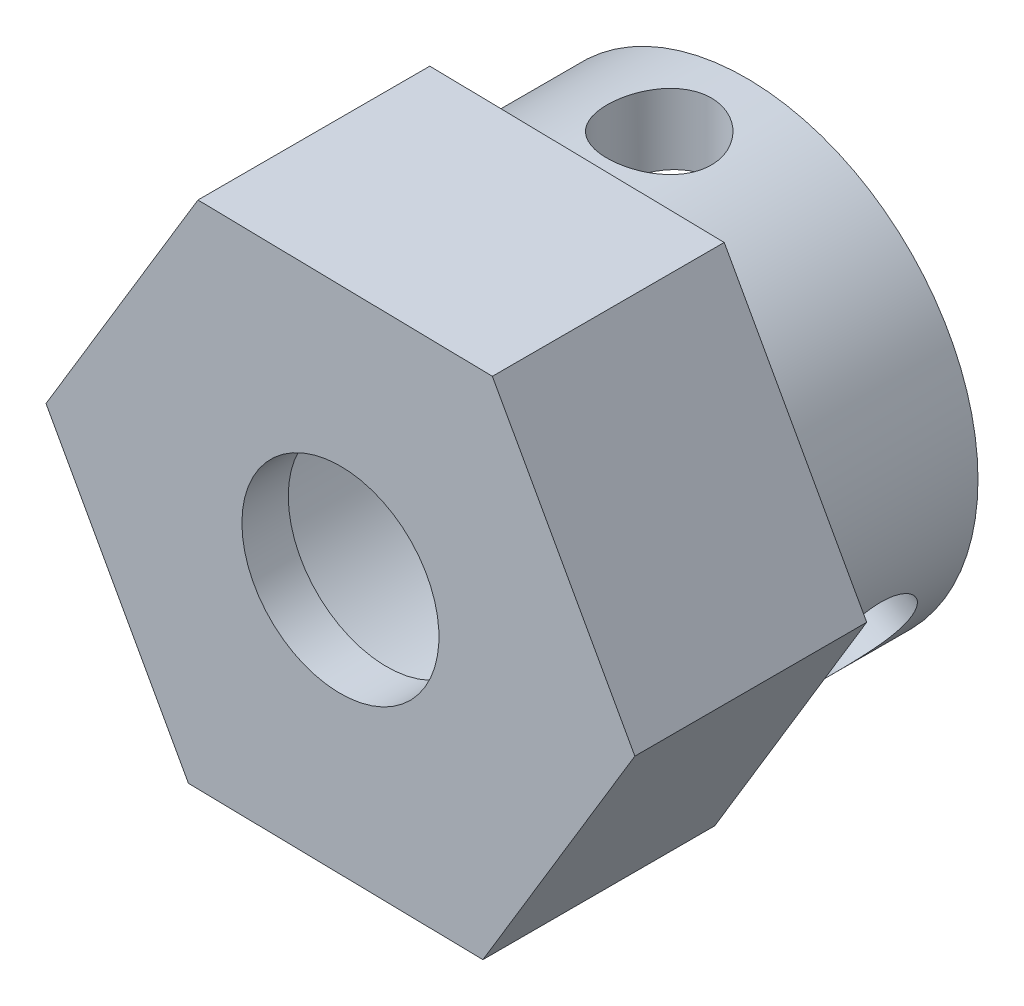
ISO-10303-21;
HEADER;
FILE_DESCRIPTION(('STEP AP214'),'2;1');
FILE_NAME('part.step','',(''),(''),'','','');
FILE_SCHEMA(('AUTOMOTIVE_DESIGN { 1 0 10303 214 1 1 1 1 }'));
ENDSEC;
DATA;
#1=APPLICATION_CONTEXT('core data for automotive mechanical design processes');
#2=APPLICATION_PROTOCOL_DEFINITION('international standard','automotive_design',2000,#1);
#3=PRODUCT_CONTEXT('',#1,'mechanical');
#4=PRODUCT('Part','Part','',(#3));
#5=PRODUCT_RELATED_PRODUCT_CATEGORY('part','',(#4));
#6=PRODUCT_DEFINITION_FORMATION('','',#4);
#7=PRODUCT_DEFINITION_CONTEXT('part definition',#1,'design');
#8=PRODUCT_DEFINITION('design','',#6,#7);
#9=PRODUCT_DEFINITION_SHAPE('','',#8);
#10=(LENGTH_UNIT() NAMED_UNIT(*) SI_UNIT(.MILLI.,.METRE.));
#11=(NAMED_UNIT(*) PLANE_ANGLE_UNIT() SI_UNIT($,.RADIAN.));
#12=(NAMED_UNIT(*) SI_UNIT($,.STERADIAN.) SOLID_ANGLE_UNIT());
#13=UNCERTAINTY_MEASURE_WITH_UNIT(LENGTH_MEASURE(1.E-05),#10,'distance_accuracy_value','');
#14=(GEOMETRIC_REPRESENTATION_CONTEXT(3) GLOBAL_UNCERTAINTY_ASSIGNED_CONTEXT((#13)) GLOBAL_UNIT_ASSIGNED_CONTEXT((#10,
#11,#12)) REPRESENTATION_CONTEXT('',''));
#15=CARTESIAN_POINT('',(0.,0.,0.));
#16=DIRECTION('',(0.,0.,1.));
#17=DIRECTION('',(1.,0.,0.));
#18=AXIS2_PLACEMENT_3D('',#15,#16,#17);
#19=CARTESIAN_POINT('',(0.,0.,-8.89));
#20=DIRECTION('',(0.,0.,1.));
#21=DIRECTION('',(1.,0.,0.));
#22=AXIS2_PLACEMENT_3D('',#19,#20,#21);
#23=CYLINDRICAL_SURFACE('',#22,5.08);
#24=CARTESIAN_POINT('',(-4.85810276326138,-1.48500422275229,-6.985));
#25=CARTESIAN_POINT('',(-4.85810281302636,-1.48500669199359,-6.92167529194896));
#26=CARTESIAN_POINT('',(-4.85652644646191,-1.49019141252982,-6.85832558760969));
#27=CARTESIAN_POINT('',(-4.85018004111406,-1.51071664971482,-6.73343108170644));
#28=CARTESIAN_POINT('',(-4.8454077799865,-1.52606423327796,-6.67188756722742));
#29=CARTESIAN_POINT('',(-4.83256581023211,-1.56625321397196,-6.55243010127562));
#30=CARTESIAN_POINT('',(-4.82449983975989,-1.59108384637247,-6.49451212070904));
#31=CARTESIAN_POINT('',(-4.80491702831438,-1.64927582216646,-6.38378022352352));
#32=CARTESIAN_POINT('',(-4.79340021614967,-1.68263709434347,-6.33096626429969));
#33=CARTESIAN_POINT('',(-4.76653900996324,-1.75729927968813,-6.2309975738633));
#34=CARTESIAN_POINT('',(-4.75113612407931,-1.79871908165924,-6.1839473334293));
#35=CARTESIAN_POINT('',(-4.71647810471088,-1.88772647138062,-6.09775782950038));
#36=CARTESIAN_POINT('',(-4.69722266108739,-1.93531455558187,-6.05861920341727));
#37=CARTESIAN_POINT('',(-4.65461791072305,-2.03566494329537,-5.98894788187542));
#38=CARTESIAN_POINT('',(-4.63122531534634,-2.08847906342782,-5.9585161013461));
#39=CARTESIAN_POINT('',(-4.5806938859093,-2.19709495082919,-5.90777581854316));
#40=CARTESIAN_POINT('',(-4.55355549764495,-2.25289636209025,-5.88746611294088));
#41=CARTESIAN_POINT('',(-4.49647154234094,-2.36474499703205,-5.85787629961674));
#42=CARTESIAN_POINT('',(-4.4665798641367,-2.42077287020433,-5.84841922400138));
#43=CARTESIAN_POINT('',(-4.40434166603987,-2.53224148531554,-5.84024940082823));
#44=CARTESIAN_POINT('',(-4.37199544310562,-2.58768229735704,-5.84153535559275));
#45=CARTESIAN_POINT('',(-4.30642272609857,-2.69537167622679,-5.85468414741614));
#46=CARTESIAN_POINT('',(-4.27322255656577,-2.74765974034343,-5.86635618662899));
#47=CARTESIAN_POINT('',(-4.20650582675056,-2.84875040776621,-5.89964127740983));
#48=CARTESIAN_POINT('',(-4.17298925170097,-2.89755284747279,-5.92125479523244));
#49=CARTESIAN_POINT('',(-4.10660651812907,-2.99090145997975,-5.97397529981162));
#50=CARTESIAN_POINT('',(-4.07374731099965,-3.0354121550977,-6.00515375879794));
#51=CARTESIAN_POINT('',(-4.01023305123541,-3.11884340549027,-6.07606564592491));
#52=CARTESIAN_POINT('',(-3.97957831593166,-3.15776315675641,-6.11580030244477));
#53=CARTESIAN_POINT('',(-3.92111564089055,-3.23008751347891,-6.20373247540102));
#54=CARTESIAN_POINT('',(-3.89338517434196,-3.26335193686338,-6.25209695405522));
#55=CARTESIAN_POINT('',(-3.84286046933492,-3.32270176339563,-6.35537238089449));
#56=CARTESIAN_POINT('',(-3.82006638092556,-3.34878694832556,-6.41028352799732));
#57=CARTESIAN_POINT('',(-3.780507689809,-3.39338435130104,-6.52536286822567));
#58=CARTESIAN_POINT('',(-3.76376314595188,-3.4118714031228,-6.58554774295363));
#59=CARTESIAN_POINT('',(-3.73734361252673,-3.44079212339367,-6.70930732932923));
#60=CARTESIAN_POINT('',(-3.72766742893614,-3.45122715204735,-6.77288146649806));
#61=CARTESIAN_POINT('',(-3.71608033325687,-3.46370012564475,-6.90014751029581));
#62=CARTESIAN_POINT('',(-3.71400663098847,-3.46591411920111,-6.96380737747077));
#63=CARTESIAN_POINT('',(-3.71729279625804,-3.46238934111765,-7.09071001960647));
#64=CARTESIAN_POINT('',(-3.72265212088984,-3.45665115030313,-7.15395282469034));
#65=CARTESIAN_POINT('',(-3.7403777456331,-3.4374612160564,-7.27740166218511));
#66=CARTESIAN_POINT('',(-3.752654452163,-3.42410807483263,-7.33763600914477));
#67=CARTESIAN_POINT('',(-3.78348450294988,-3.3900103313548,-7.45428350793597));
#68=CARTESIAN_POINT('',(-3.80203847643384,-3.36926498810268,-7.51069627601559));
#69=CARTESIAN_POINT('',(-3.84483572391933,-3.32034749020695,-7.6191072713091));
#70=CARTESIAN_POINT('',(-3.86916637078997,-3.29206036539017,-7.67101908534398));
#71=CARTESIAN_POINT('',(-3.92218656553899,-3.22870794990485,-7.76803942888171));
#72=CARTESIAN_POINT('',(-3.95087668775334,-3.19364176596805,-7.81314706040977));
#73=CARTESIAN_POINT('',(-4.01195015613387,-3.11658718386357,-7.89619381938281));
#74=CARTESIAN_POINT('',(-4.04439545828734,-3.07447530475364,-7.93397305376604));
#75=CARTESIAN_POINT('',(-4.1111067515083,-2.98468170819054,-8.00014382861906));
#76=CARTESIAN_POINT('',(-4.14537265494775,-2.9370002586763,-8.0285358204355));
#77=CARTESIAN_POINT('',(-4.21411013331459,-2.83748220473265,-8.07490724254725));
#78=CARTESIAN_POINT('',(-4.24857882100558,-2.78567537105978,-8.09295472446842));
#79=CARTESIAN_POINT('',(-4.31665742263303,-2.67896808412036,-8.11833603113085));
#80=CARTESIAN_POINT('',(-4.35026746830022,-2.6240681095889,-8.12567150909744));
#81=CARTESIAN_POINT('',(-4.4147866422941,-2.51396929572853,-8.12934264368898));
#82=CARTESIAN_POINT('',(-4.4457388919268,-2.45880353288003,-8.1259164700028));
#83=CARTESIAN_POINT('',(-4.50491361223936,-2.34863026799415,-8.10869672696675));
#84=CARTESIAN_POINT('',(-4.53313613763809,-2.29362276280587,-8.09490336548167));
#85=CARTESIAN_POINT('',(-4.58617880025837,-2.18562885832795,-8.0574576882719));
#86=CARTESIAN_POINT('',(-4.61101079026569,-2.13263591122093,-8.03384095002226));
#87=CARTESIAN_POINT('',(-4.65707873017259,-2.03006953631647,-7.97745293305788));
#88=CARTESIAN_POINT('',(-4.67831430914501,-1.98049646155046,-7.94468071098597));
#89=CARTESIAN_POINT('',(-4.71747218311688,-1.88535368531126,-7.87014496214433));
#90=CARTESIAN_POINT('',(-4.7353198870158,-1.83988363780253,-7.82821502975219));
#91=CARTESIAN_POINT('',(-4.76722061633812,-1.75557516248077,-7.73688740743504));
#92=CARTESIAN_POINT('',(-4.78127271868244,-1.71673834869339,-7.68748790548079));
#93=CARTESIAN_POINT('',(-4.80589712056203,-1.64655986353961,-7.58177154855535));
#94=CARTESIAN_POINT('',(-4.8164166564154,-1.61533360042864,-7.52536569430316));
#95=CARTESIAN_POINT('',(-4.83386659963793,-1.56234371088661,-7.40779030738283));
#96=CARTESIAN_POINT('',(-4.84079996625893,-1.54057228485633,-7.34662475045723));
#97=CARTESIAN_POINT('',(-4.85006780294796,-1.5110992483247,-7.23535537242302));
#98=CARTESIAN_POINT('',(-4.85308454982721,-1.50133836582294,-7.18584290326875));
#99=CARTESIAN_POINT('',(-4.85710195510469,-1.48829004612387,-7.08589221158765));
#100=CARTESIAN_POINT('',(-4.85810272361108,-1.48500225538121,-7.03545403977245));
#101=CARTESIAN_POINT('',(-4.85810276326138,-1.48500422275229,-6.985));
#102=B_SPLINE_CURVE_WITH_KNOTS('',3,(#24,#25,#26,#27,#28,#29,#30,#31,#32,#33,#34,#35,#36,#37,
#38,#39,#40,#41,#42,#43,#44,#45,#46,#47,#48,#49,#50,#51,#52,#53,#54,#55,#56,#57,#58,#59,#60,#61,
#62,#63,#64,#65,#66,#67,#68,#69,#70,#71,#72,#73,#74,#75,#76,#77,#78,#79,#80,#81,#82,#83,#84,#85,
#86,#87,#88,#89,#90,#91,#92,#93,#94,#95,#96,#97,#98,#99,#100,#101),.UNSPECIFIED.,.T.,.F.,(4,2,2,
2,2,2,2,2,2,2,2,2,2,2,2,2,2,2,2,2,2,2,2,2,2,2,2,2,2,2,2,2,2,2,2,2,2,2,4),(0.,0.189789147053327,
0.379710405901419,0.56941671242,0.759121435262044,0.951872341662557,1.14463877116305,
1.3395564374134,1.53445092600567,1.7261200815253,1.91776608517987,2.10596250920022,
2.29416776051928,2.48381508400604,2.67348965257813,2.8673373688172,3.0611909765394,
3.25568158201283,3.45013932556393,3.64040803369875,3.83066284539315,4.01850833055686,
4.2063726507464,4.39728316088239,4.58821884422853,4.78294086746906,4.97765352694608,
5.17107011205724,5.36445684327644,5.55359406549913,5.74272749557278,5.93118182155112,
6.11965557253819,6.31189115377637,6.50417344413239,6.69921175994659,6.89408887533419,
7.04531187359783,7.19652661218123),.UNSPECIFIED.);
#103=CARTESIAN_POINT('',(-4.85810276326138,-1.48500422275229,-6.985));
#104=VERTEX_POINT('',#103);
#105=EDGE_CURVE('E221',#104,#104,#102,.T.);
#106=ORIENTED_EDGE('',*,*,#105,.T.);
#107=EDGE_LOOP('',(#106));
#108=FACE_BOUND('',#107,.T.);
#109=CARTESIAN_POINT('',(0.,0.,-5.08));
#110=DIRECTION('',(0.,0.,1.));
#111=DIRECTION('',(1.,0.,0.));
#112=AXIS2_PLACEMENT_3D('',#109,#110,#111);
#113=CIRCLE('',#112,5.08);
#114=CARTESIAN_POINT('',(5.08,0.,-5.08));
#115=VERTEX_POINT('',#114);
#116=EDGE_CURVE('E47',#115,#115,#113,.F.);
#117=ORIENTED_EDGE('',*,*,#116,.T.);
#118=EDGE_LOOP('',(#117));
#119=FACE_BOUND('',#118,.T.);
#120=CARTESIAN_POINT('',(0.,0.,-8.89));
#121=DIRECTION('',(0.,0.,1.));
#122=DIRECTION('',(1.,0.,0.));
#123=AXIS2_PLACEMENT_3D('',#120,#121,#122);
#124=CIRCLE('',#123,5.08);
#125=CARTESIAN_POINT('',(5.08,0.,-8.89));
#126=VERTEX_POINT('',#125);
#127=EDGE_CURVE('E11',#126,#126,#124,.T.);
#128=ORIENTED_EDGE('',*,*,#127,.T.);
#129=EDGE_LOOP('',(#128));
#130=FACE_BOUND('',#129,.T.);
#131=CARTESIAN_POINT('',(0.,5.08,-8.128));
#132=CARTESIAN_POINT('',(0.0633475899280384,5.07999884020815,-8.12799790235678));
#133=CARTESIAN_POINT('',(0.126720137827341,5.0788030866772,-8.12271593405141));
#134=CARTESIAN_POINT('',(0.251662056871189,5.07414854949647,-8.10175139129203));
#135=CARTESIAN_POINT('',(0.313230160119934,5.07068821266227,-8.0860616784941));
#136=CARTESIAN_POINT('',(0.4327397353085,5.06188939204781,-8.04480039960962));
#137=CARTESIAN_POINT('',(0.490685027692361,5.05655292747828,-8.01923945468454));
#138=CARTESIAN_POINT('',(0.601463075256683,5.04457634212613,-7.9589957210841));
#139=CARTESIAN_POINT('',(0.65429590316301,5.0379362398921,-7.92431306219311));
#140=CARTESIAN_POINT('',(0.754244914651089,5.02395291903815,-7.84618955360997));
#141=CARTESIAN_POINT('',(0.801262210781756,5.01660056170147,-7.80262381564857));
#142=CARTESIAN_POINT('',(0.887387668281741,5.00208506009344,-7.70823879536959));
#143=CARTESIAN_POINT('',(0.926495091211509,4.99492193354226,-7.65741883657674));
#144=CARTESIAN_POINT('',(0.996132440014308,4.9815054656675,-7.54922982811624));
#145=CARTESIAN_POINT('',(1.02655607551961,4.97526381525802,-7.49179078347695));
#146=CARTESIAN_POINT('',(1.07728011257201,4.96452860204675,-7.37245151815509));
#147=CARTESIAN_POINT('',(1.09758180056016,4.96003481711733,-7.31055186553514));
#148=CARTESIAN_POINT('',(1.1271568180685,4.95339738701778,-7.18512409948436));
#149=CARTESIAN_POINT('',(1.13660576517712,4.9512163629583,-7.12163941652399));
#150=CARTESIAN_POINT('',(1.14475333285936,4.94933921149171,-6.99395133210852));
#151=CARTESIAN_POINT('',(1.14345335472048,4.94964276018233,-6.92974802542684));
#152=CARTESIAN_POINT('',(1.13028106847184,4.95266666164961,-6.80375829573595));
#153=CARTESIAN_POINT('',(1.11861375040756,4.95534015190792,-6.74194914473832));
#154=CARTESIAN_POINT('',(1.08536316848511,4.96272849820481,-6.62118864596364));
#155=CARTESIAN_POINT('',(1.06377931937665,4.96744347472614,-6.56223746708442));
#156=CARTESIAN_POINT('',(1.01112275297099,4.97842910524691,-6.44829514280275));
#157=CARTESIAN_POINT('',(0.979972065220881,4.98471245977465,-6.39334130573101));
#158=CARTESIAN_POINT('',(0.909120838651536,4.99811920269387,-6.28936540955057));
#159=CARTESIAN_POINT('',(0.869419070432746,5.00524271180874,-6.2403442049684));
#160=CARTESIAN_POINT('',(0.781511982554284,5.01972748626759,-6.14844590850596));
#161=CARTESIAN_POINT('',(0.733132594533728,5.02709045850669,-6.10573542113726));
#162=CARTESIAN_POINT('',(0.629813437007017,5.04107611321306,-6.02900598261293));
#163=CARTESIAN_POINT('',(0.574873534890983,5.04769878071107,-5.99498720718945));
#164=CARTESIAN_POINT('',(0.459783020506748,5.05948113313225,-5.93656195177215));
#165=CARTESIAN_POINT('',(0.399620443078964,5.06463733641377,-5.91217829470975));
#166=CARTESIAN_POINT('',(0.275909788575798,5.0728800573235,-5.87391353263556));
#167=CARTESIAN_POINT('',(0.212362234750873,5.07596689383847,-5.860030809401));
#168=CARTESIAN_POINT('',(0.08511369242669,5.07967734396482,-5.84340661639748));
#169=CARTESIAN_POINT('',(0.0214438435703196,5.08035123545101,-5.84043770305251));
#170=CARTESIAN_POINT('',(-0.105482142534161,5.0793011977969,-5.84510753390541));
#171=CARTESIAN_POINT('',(-0.168738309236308,5.07757744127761,-5.85274551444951));
#172=CARTESIAN_POINT('',(-0.292280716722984,5.071957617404,-5.87822389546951));
#173=CARTESIAN_POINT('',(-0.352593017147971,5.06808715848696,-5.89594408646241));
#174=CARTESIAN_POINT('',(-0.469388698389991,5.05860756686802,-5.94094971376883));
#175=CARTESIAN_POINT('',(-0.525871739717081,5.05299828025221,-5.9682359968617));
#176=CARTESIAN_POINT('',(-0.634339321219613,5.0405398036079,-6.03206677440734));
#177=CARTESIAN_POINT('',(-0.686243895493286,5.03367331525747,-6.0687437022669));
#178=CARTESIAN_POINT('',(-0.783243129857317,5.01949573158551,-6.15014125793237));
#179=CARTESIAN_POINT('',(-0.828336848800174,5.01218457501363,-6.19486299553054));
#180=CARTESIAN_POINT('',(-0.911340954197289,4.99776657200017,-6.29212700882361));
#181=CARTESIAN_POINT('',(-0.949093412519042,4.99066652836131,-6.34480525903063));
#182=CARTESIAN_POINT('',(-1.01521721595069,4.97763742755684,-6.45588735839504));
#183=CARTESIAN_POINT('',(-1.04358897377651,4.97170831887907,-6.51429095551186));
#184=CARTESIAN_POINT('',(-1.08994921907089,4.96175103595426,-6.63484917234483));
#185=CARTESIAN_POINT('',(-1.1079972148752,4.95771199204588,-6.69697996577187));
#186=CARTESIAN_POINT('',(-1.13336929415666,4.95197398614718,-6.82349564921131));
#187=CARTESIAN_POINT('',(-1.14069520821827,4.95027462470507,-6.88788015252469));
#188=CARTESIAN_POINT('',(-1.14433376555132,4.94943459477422,-7.01548066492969));
#189=CARTESIAN_POINT('',(-1.14089715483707,4.95023566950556,-7.07868926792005));
#190=CARTESIAN_POINT('',(-1.12367131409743,4.95417393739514,-7.20360170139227));
#191=CARTESIAN_POINT('',(-1.10988222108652,4.95731109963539,-7.26530555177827));
#192=CARTESIAN_POINT('',(-1.07246713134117,4.96553886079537,-7.38524375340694));
#193=CARTESIAN_POINT('',(-1.0488796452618,4.97062180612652,-7.44349067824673));
#194=CARTESIAN_POINT('',(-0.992569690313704,4.98217099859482,-7.55523698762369));
#195=CARTESIAN_POINT('',(-0.959846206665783,4.98863739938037,-7.60873584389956));
#196=CARTESIAN_POINT('',(-0.885370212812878,5.00239742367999,-7.71069890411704));
#197=CARTESIAN_POINT('',(-0.843439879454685,5.00970575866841,-7.75903126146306));
#198=CARTESIAN_POINT('',(-0.752098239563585,5.02422956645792,-7.84805581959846));
#199=CARTESIAN_POINT('',(-0.702685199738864,5.0314450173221,-7.88874624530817));
#200=CARTESIAN_POINT('',(-0.596952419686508,5.0450892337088,-7.96187568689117));
#201=CARTESIAN_POINT('',(-0.540546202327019,5.05150566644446,-7.994192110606));
#202=CARTESIAN_POINT('',(-0.422968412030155,5.06270412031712,-8.04883360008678));
#203=CARTESIAN_POINT('',(-0.361800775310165,5.06748747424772,-8.0711668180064));
#204=CARTESIAN_POINT('',(-0.250501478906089,5.0740547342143,-8.10135227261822));
#205=CARTESIAN_POINT('',(-0.200959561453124,5.07627012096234,-8.11132564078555));
#206=CARTESIAN_POINT('',(-0.100950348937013,5.07924318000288,-8.12465017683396));
#207=CARTESIAN_POINT('',(-0.0504830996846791,5.08000092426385,-8.12800167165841));
#208=CARTESIAN_POINT('',(0.,5.08,-8.128));
#209=B_SPLINE_CURVE_WITH_KNOTS('',3,(#131,#132,#133,#134,#135,#136,#137,#138,#139,#140,#141,
#142,#143,#144,#145,#146,#147,#148,#149,#150,#151,#152,#153,#154,#155,#156,#157,#158,#159,#160,
#161,#162,#163,#164,#165,#166,#167,#168,#169,#170,#171,#172,#173,#174,#175,#176,#177,#178,#179,
#180,#181,#182,#183,#184,#185,#186,#187,#188,#189,#190,#191,#192,#193,#194,#195,#196,#197,#198,
#199,#200,#201,#202,#203,#204,#205,#206,#207,#208),.UNSPECIFIED.,.T.,.F.,(4,2,2,2,2,2,2,2,2,2,2,
2,2,2,2,2,2,2,2,2,2,2,2,2,2,2,2,2,2,2,2,2,2,2,2,2,2,2,4),(0.,0.189857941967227,
0.379846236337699,0.569630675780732,0.759412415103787,0.952073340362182,1.14475224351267,
1.33969726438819,1.534617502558,1.72633704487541,1.91803159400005,2.10601813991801,
2.29401578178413,2.48358821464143,2.67318792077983,2.86713391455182,3.06108382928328,
3.25549044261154,3.4498670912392,3.64016920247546,3.83045761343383,4.018523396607,
4.20660583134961,4.39750280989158,4.58842614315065,4.7830875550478,4.97774040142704,
5.17125961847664,5.36474579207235,5.55375792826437,5.74276756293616,5.93104125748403,
6.11933587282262,6.31164982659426,6.50400839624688,6.69904148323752,6.89391501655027,
7.04522449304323,7.19652649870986),.UNSPECIFIED.);
#210=CARTESIAN_POINT('',(0.,5.08,-8.128));
#211=VERTEX_POINT('',#210);
#212=EDGE_CURVE('E162',#211,#211,#209,.T.);
#213=ORIENTED_EDGE('',*,*,#212,.T.);
#214=EDGE_LOOP('',(#213));
#215=FACE_BOUND('',#214,.T.);
#216=CARTESIAN_POINT('',(3.71510276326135,-3.46473829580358,-6.985));
#217=CARTESIAN_POINT('',(3.71510492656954,-3.46473710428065,-6.92167529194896));
#218=CARTESIAN_POINT('',(3.71880684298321,-3.46077957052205,-6.85832558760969));
#219=CARTESIAN_POINT('',(3.7334090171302,-3.4450208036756,-6.73343108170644));
#220=CARTESIAN_POINT('',(3.7443142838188,-3.43321411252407,-6.67188756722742));
#221=CARTESIAN_POINT('',(3.77269797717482,-3.40199815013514,-6.55243010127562));
#222=CARTESIAN_POINT('',(3.79016895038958,-3.38259749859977,-6.49451212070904));
#223=CARTESIAN_POINT('',(3.83077327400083,-3.33654229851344,-6.38378022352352));
#224=CARTESIAN_POINT('',(3.85390657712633,-3.30988781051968,-6.33096626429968));
#225=CARTESIAN_POINT('',(3.90513532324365,-3.24929423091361,-6.2309975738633));
#226=CARTESIAN_POINT('',(3.93330448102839,-3.21524503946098,-6.1839473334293));
#227=CARTESIAN_POINT('',(3.99305813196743,-3.14072661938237,-6.09775782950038));
#228=CARTESIAN_POINT('',(4.0246428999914,-3.10025687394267,-6.05861920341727));
#229=CARTESIAN_POINT('',(4.09024650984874,-3.01318488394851,-5.98894788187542));
#230=CARTESIAN_POINT('',(4.1242885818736,-2.9665192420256,-5.9585161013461));
#231=CARTESIAN_POINT('',(4.19308698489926,-2.8684497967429,-5.90777581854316));
#232=CARTESIAN_POINT('',(4.22784323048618,-2.81704655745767,-5.88746611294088));
#233=CARTESIAN_POINT('',(4.29616501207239,-2.711686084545,-5.85787629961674));
#234=CARTESIAN_POINT('',(4.32974073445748,-2.65778519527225,-5.84841922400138));
#235=CARTESIAN_POINT('',(4.39515628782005,-2.54815102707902,-5.84024940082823));
#236=CARTESIAN_POINT('',(4.4269963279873,-2.49241797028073,-5.84153535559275));
#237=CARTESIAN_POINT('',(4.48747170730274,-2.38178564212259,-5.85468414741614));
#238=CARTESIAN_POINT('',(4.51615441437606,-2.32688941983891,-5.86635618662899));
#239=CARTESIAN_POINT('',(4.5703431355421,-2.21856570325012,-5.89964127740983));
#240=CARTESIAN_POINT('',(4.59584900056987,-2.16513827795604,-5.92125479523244));
#241=CARTESIAN_POINT('',(4.64349990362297,-2.06097483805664,-5.97397529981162));
#242=CARTESIAN_POINT('',(4.66561769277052,-2.01026258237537,-6.00515375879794));
#243=CARTESIAN_POINT('',(4.70611414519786,-1.91354199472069,-6.07606564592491));
#244=CARTESIAN_POINT('',(4.72449227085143,-1.86753433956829,-6.11580030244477));
#245=CARTESIAN_POINT('',(4.75789566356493,-1.78074199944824,-6.20373247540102));
#246=CARTESIAN_POINT('',(4.77283826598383,-1.74009449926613,-6.25209695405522));
#247=CARTESIAN_POINT('',(4.79897437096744,-1.6666639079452,-6.35537238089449));
#248=CARTESIAN_POINT('',(4.81016775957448,-1.63388105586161,-6.41028352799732));
#249=CARTESIAN_POINT('',(4.82901089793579,-1.57732352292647,-6.52536286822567));
#250=CARTESIAN_POINT('',(4.83664888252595,-1.55357879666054,-6.58554774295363));
#251=CARTESIAN_POINT('',(4.84848519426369,-1.51623844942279,-6.70930732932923));
#252=CARTESIAN_POINT('',(4.8526841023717,-1.50264111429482,-6.77288146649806));
#253=CARTESIAN_POINT('',(4.85769246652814,-1.4863699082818,-6.90014751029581));
#254=CARTESIAN_POINT('',(4.85857299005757,-1.4834670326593,-6.96380737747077));
#255=CARTESIAN_POINT('',(4.85716352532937,-1.48807532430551,-7.09071001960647));
#256=CARTESIAN_POINT('',(4.85487376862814,-1.49558573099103,-7.15395282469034));
#257=CARTESIAN_POINT('',(4.84711761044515,-1.52053153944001,-7.27740166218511));
#258=CARTESIAN_POINT('',(4.84169180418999,-1.5378400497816,-7.33763600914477));
#259=CARTESIAN_POINT('',(4.8275773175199,-1.58158852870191,-7.45428350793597));
#260=CARTESIAN_POINT('',(4.81888830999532,-1.60802941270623,-7.51069627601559));
#261=CARTESIAN_POINT('',(4.7979231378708,-1.66955166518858,-7.6191072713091));
#262=CARTESIAN_POINT('',(4.78559109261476,-1.70476618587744,-7.67101908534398));
#263=CARTESIAN_POINT('',(4.75723638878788,-1.78235922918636,-7.76803942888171));
#264=CARTESIAN_POINT('',(4.741213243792,-1.82473869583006,-7.81314706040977));
#265=CARTESIAN_POINT('',(4.7050187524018,-1.91615716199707,-7.89619381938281));
#266=CARTESIAN_POINT('',(4.68477144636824,-1.9653115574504,-7.93397305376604));
#267=CARTESIAN_POINT('',(4.6403635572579,-2.06798203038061,-8.00014382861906));
#268=CARTESIAN_POINT('',(4.61620316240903,-2.12149789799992,-8.0285358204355));
#269=CARTESIAN_POINT('',(4.56438673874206,-2.23078532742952,-8.07490724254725));
#270=CARTESIAN_POINT('',(4.53675504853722,-2.28653950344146,-8.09295472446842));
#271=CARTESIAN_POINT('',(4.47838312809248,-2.39885094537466,-8.11833603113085));
#272=CARTESIAN_POINT('',(4.44764337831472,-2.45540808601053,-8.12567150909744));
#273=CARTESIAN_POINT('',(4.38455459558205,-2.56633273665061,-8.12934264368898));
#274=CARTESIAN_POINT('',(4.35225576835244,-2.62072105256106,-8.1259164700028));
#275=CARTESIAN_POINT('',(4.28643028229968,-2.72705449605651,-8.10869672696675));
#276=CARTESIAN_POINT('',(4.25290364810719,-2.7789996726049,-8.09490336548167));
#277=CARTESIAN_POINT('',(4.18589951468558,-2.8789329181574,-8.0574576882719));
#278=CARTESIAN_POINT('',(4.15242227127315,-2.92693452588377,-8.03384095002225));
#279=CARTESIAN_POINT('',(4.08663115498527,-3.01811371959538,-7.97745293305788));
#280=CARTESIAN_POINT('',(4.0543174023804,-3.06129080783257,-7.94468071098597));
#281=CARTESIAN_POINT('',(3.99150027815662,-3.14277390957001,-7.87014496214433));
#282=CARTESIAN_POINT('',(3.96104591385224,-3.18096549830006,-7.82821502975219));
#283=CARTESIAN_POINT('',(3.90398299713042,-3.25074657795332,-7.73688740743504));
#284=CARTESIAN_POINT('',(3.87737538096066,-3.28233446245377,-7.68748790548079));
#285=CARTESIAN_POINT('',(3.82891123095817,-3.33874906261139,-7.58177154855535));
#286=CARTESIAN_POINT('',(3.8071282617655,-3.3634723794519,-7.52536569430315));
#287=CARTESIAN_POINT('',(3.76996264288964,-3.40507941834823,-7.40779030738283));
#288=CARTESIAN_POINT('',(3.7545747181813,-3.4219696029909,-7.34662475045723));
#289=CARTESIAN_POINT('',(3.73368423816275,-3.44473230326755,-7.23535537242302));
#290=CARTESIAN_POINT('',(3.7267394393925,-3.45222532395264,-7.18584290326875));
#291=CARTESIAN_POINT('',(3.71744796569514,-3.46222865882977,-7.08589221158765));
#292=CARTESIAN_POINT('',(3.71510103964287,-3.46473924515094,-7.03545403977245));
#293=CARTESIAN_POINT('',(3.71510276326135,-3.46473829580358,-6.985));
#294=B_SPLINE_CURVE_WITH_KNOTS('',3,(#216,#217,#218,#219,#220,#221,#222,#223,#224,#225,#226,
#227,#228,#229,#230,#231,#232,#233,#234,#235,#236,#237,#238,#239,#240,#241,#242,#243,#244,#245,
#246,#247,#248,#249,#250,#251,#252,#253,#254,#255,#256,#257,#258,#259,#260,#261,#262,#263,#264,
#265,#266,#267,#268,#269,#270,#271,#272,#273,#274,#275,#276,#277,#278,#279,#280,#281,#282,#283,
#284,#285,#286,#287,#288,#289,#290,#291,#292,#293),.UNSPECIFIED.,.T.,.F.,(4,2,2,2,2,2,2,2,2,2,2,
2,2,2,2,2,2,2,2,2,2,2,2,2,2,2,2,2,2,2,2,2,2,2,2,2,2,2,4),(0.,0.189789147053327,
0.379710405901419,0.56941671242,0.759121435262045,0.951872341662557,1.14463877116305,
1.3395564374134,1.53445092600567,1.7261200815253,1.91776608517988,2.10596250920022,
2.29416776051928,2.48381508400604,2.67348965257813,2.8673373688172,3.0611909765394,
3.25568158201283,3.45013932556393,3.64040803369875,3.83066284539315,4.01850833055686,
4.2063726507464,4.39728316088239,4.58821884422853,4.78294086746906,4.97765352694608,
5.17107011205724,5.36445684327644,5.55359406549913,5.74272749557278,5.93118182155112,
6.11965557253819,6.31189115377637,6.50417344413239,6.69921175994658,6.89408887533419,
7.04531187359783,7.19652661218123),.UNSPECIFIED.);
#295=CARTESIAN_POINT('',(3.71510276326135,-3.46473829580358,-6.985));
#296=VERTEX_POINT('',#295);
#297=EDGE_CURVE('E163',#296,#296,#294,.T.);
#298=ORIENTED_EDGE('',*,*,#297,.T.);
#299=EDGE_LOOP('',(#298));
#300=FACE_BOUND('',#299,.T.);
#301=ADVANCED_FACE('F33',(#108,#119,#130,#215,#300),#23,.T.);
#302=CARTESIAN_POINT('',(0.,0.,-1.016));
#303=DIRECTION('',(0.,0.,-1.));
#304=DIRECTION('',(-1.,0.,0.));
#305=AXIS2_PLACEMENT_3D('',#302,#303,#304);
#306=CYLINDRICAL_SURFACE('',#305,3.556);
#307=CARTESIAN_POINT('',(0.,0.,-1.016));
#308=DIRECTION('',(0.,0.,-1.));
#309=DIRECTION('',(-1.,0.,0.));
#310=AXIS2_PLACEMENT_3D('',#307,#308,#309);
#311=CIRCLE('',#310,3.556);
#312=CARTESIAN_POINT('',(-3.556,0.,-1.016));
#313=VERTEX_POINT('',#312);
#314=EDGE_CURVE('E131',#313,#313,#311,.T.);
#315=ORIENTED_EDGE('',*,*,#314,.F.);
#316=EDGE_LOOP('',(#315));
#317=FACE_BOUND('',#316,.T.);
#318=CARTESIAN_POINT('',(0.,0.,-8.89));
#319=DIRECTION('',(0.,0.,-1.));
#320=DIRECTION('',(-1.,0.,0.));
#321=AXIS2_PLACEMENT_3D('',#318,#319,#320);
#322=CIRCLE('',#321,3.556);
#323=CARTESIAN_POINT('',(-3.556,0.,-8.89));
#324=VERTEX_POINT('',#323);
#325=EDGE_CURVE('E155',#324,#324,#322,.T.);
#326=ORIENTED_EDGE('',*,*,#325,.T.);
#327=EDGE_LOOP('',(#326));
#328=FACE_BOUND('',#327,.T.);
#329=CARTESIAN_POINT('',(0.,3.556,-8.128));
#330=CARTESIAN_POINT('',(0.0624901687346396,3.55599987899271,-8.12799987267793));
#331=CARTESIAN_POINT('',(0.12498208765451,3.55433737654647,-8.12285849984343));
#332=CARTESIAN_POINT('',(0.248132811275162,3.54786856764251,-8.1024865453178));
#333=CARTESIAN_POINT('',(0.308791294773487,3.54306171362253,-8.08725420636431));
#334=CARTESIAN_POINT('',(0.426481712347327,3.53082813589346,-8.04727105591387));
#335=CARTESIAN_POINT('',(0.483519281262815,3.52340560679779,-8.02253547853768));
#336=CARTESIAN_POINT('',(0.592636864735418,3.50670335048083,-7.96431452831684));
#337=CARTESIAN_POINT('',(0.644716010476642,3.49742329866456,-7.93082762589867));
#338=CARTESIAN_POINT('',(0.744129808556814,3.47765043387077,-7.85491094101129));
#339=CARTESIAN_POINT('',(0.791280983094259,3.46713007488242,-7.81224810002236));
#340=CARTESIAN_POINT('',(0.877897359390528,3.44621843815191,-7.71968648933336));
#341=CARTESIAN_POINT('',(0.917361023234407,3.43582718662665,-7.6697862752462));
#342=CARTESIAN_POINT('',(0.988498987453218,3.41605158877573,-7.56255137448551));
#343=CARTESIAN_POINT('',(1.01994017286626,3.40670106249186,-7.50505521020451));
#344=CARTESIAN_POINT('',(1.07262970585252,3.39048183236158,-7.38524218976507));
#345=CARTESIAN_POINT('',(1.09388091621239,3.38361243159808,-7.32292669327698));
#346=CARTESIAN_POINT('',(1.12490873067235,3.37342216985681,-7.19732130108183));
#347=CARTESIAN_POINT('',(1.13502716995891,3.36999589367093,-7.13412464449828));
#348=CARTESIAN_POINT('',(1.14457047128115,3.36676731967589,-7.00684493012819));
#349=CARTESIAN_POINT('',(1.14399836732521,3.36696399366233,-6.94276212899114));
#350=CARTESIAN_POINT('',(1.13244335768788,3.37086633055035,-6.81839325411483));
#351=CARTESIAN_POINT('',(1.12189978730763,3.37442390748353,-6.75806092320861));
#352=CARTESIAN_POINT('',(1.09141530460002,3.38440589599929,-6.64007169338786));
#353=CARTESIAN_POINT('',(1.07147334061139,3.39083062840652,-6.58241509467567));
#354=CARTESIAN_POINT('',(1.02245753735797,3.40593312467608,-6.47038788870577));
#355=CARTESIAN_POINT('',(0.993249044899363,3.41464376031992,-6.41608081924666));
#356=CARTESIAN_POINT('',(0.92662279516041,3.43332207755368,-6.31299689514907));
#357=CARTESIAN_POINT('',(0.889202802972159,3.44329010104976,-6.26422155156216));
#358=CARTESIAN_POINT('',(0.80507922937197,3.46394930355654,-6.17110810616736));
#359=CARTESIAN_POINT('',(0.758014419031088,3.47465215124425,-6.12709831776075));
#360=CARTESIAN_POINT('',(0.657039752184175,3.495151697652,-6.04751378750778));
#361=CARTESIAN_POINT('',(0.603129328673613,3.50494832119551,-6.01193974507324));
#362=CARTESIAN_POINT('',(0.489334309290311,3.52264496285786,-5.94999664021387));
#363=CARTESIAN_POINT('',(0.429402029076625,3.53052782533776,-5.92370994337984));
#364=CARTESIAN_POINT('',(0.305653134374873,3.54338466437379,-5.88169080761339));
#365=CARTESIAN_POINT('',(0.241837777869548,3.54835957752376,-5.86595497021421));
#366=CARTESIAN_POINT('',(0.114917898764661,3.55468739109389,-5.84605290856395));
#367=CARTESIAN_POINT('',(0.0518898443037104,3.55617924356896,-5.84144258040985));
#368=CARTESIAN_POINT('',(-0.0740483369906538,3.55578623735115,-5.84266481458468));
#369=CARTESIAN_POINT('',(-0.136958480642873,3.55390190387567,-5.84849575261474));
#370=CARTESIAN_POINT('',(-0.259134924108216,3.54705975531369,-5.87008054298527));
#371=CARTESIAN_POINT('',(-0.318453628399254,3.54218493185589,-5.88556663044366));
#372=CARTESIAN_POINT('',(-0.433631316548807,3.5299372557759,-5.92569201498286));
#373=CARTESIAN_POINT('',(-0.489489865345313,3.52256408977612,-5.95033246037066));
#374=CARTESIAN_POINT('',(-0.597730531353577,3.50584240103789,-6.00875973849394));
#375=CARTESIAN_POINT('',(-0.649989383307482,3.49644873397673,-6.04276164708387));
#376=CARTESIAN_POINT('',(-0.748206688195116,3.47675653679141,-6.11869093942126));
#377=CARTESIAN_POINT('',(-0.794163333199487,3.46645774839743,-6.16062058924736));
#378=CARTESIAN_POINT('',(-0.88048090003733,3.4455690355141,-6.25330440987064));
#379=CARTESIAN_POINT('',(-0.920525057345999,3.43498509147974,-6.30435562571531));
#380=CARTESIAN_POINT('',(-0.991511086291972,3.41517270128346,-6.41268236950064));
#381=CARTESIAN_POINT('',(-1.02245301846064,3.40594424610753,-6.46995785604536));
#382=CARTESIAN_POINT('',(-1.07418223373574,3.3899857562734,-6.58904451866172));
#383=CARTESIAN_POINT('',(-1.09500167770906,3.38324782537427,-6.65084060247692));
#384=CARTESIAN_POINT('',(-1.12585656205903,3.37310716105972,-6.77732484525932));
#385=CARTESIAN_POINT('',(-1.13589641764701,3.36970306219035,-6.84201180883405));
#386=CARTESIAN_POINT('',(-1.14457825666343,3.3667633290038,-6.96911449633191));
#387=CARTESIAN_POINT('',(-1.14374241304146,3.36705046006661,-7.03149087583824));
#388=CARTESIAN_POINT('',(-1.13196749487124,3.37102704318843,-7.15516649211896));
#389=CARTESIAN_POINT('',(-1.12102894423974,3.37471631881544,-7.21646578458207));
#390=CARTESIAN_POINT('',(-1.08971736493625,3.38495415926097,-7.33525383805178));
#391=CARTESIAN_POINT('',(-1.06950202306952,3.39145483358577,-7.39278860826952));
#392=CARTESIAN_POINT('',(-1.0203362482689,3.40656840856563,-7.5036950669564));
#393=CARTESIAN_POINT('',(-0.991383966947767,3.41518175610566,-7.55706587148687));
#394=CARTESIAN_POINT('',(-0.924177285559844,3.43399124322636,-7.66050265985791));
#395=CARTESIAN_POINT('',(-0.885589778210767,3.44423784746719,-7.71034299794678));
#396=CARTESIAN_POINT('',(-0.800784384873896,3.46493621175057,-7.80300990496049));
#397=CARTESIAN_POINT('',(-0.754564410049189,3.47538802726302,-7.84583454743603));
#398=CARTESIAN_POINT('',(-0.653846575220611,3.4957614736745,-7.92477071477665));
#399=CARTESIAN_POINT('',(-0.599114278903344,3.50565141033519,-7.96059225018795));
#400=CARTESIAN_POINT('',(-0.48408841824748,3.52337525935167,-8.02248199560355));
#401=CARTESIAN_POINT('',(-0.423796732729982,3.53120986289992,-8.0485534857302));
#402=CARTESIAN_POINT('',(-0.30358034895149,3.5434975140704,-8.08864245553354));
#403=CARTESIAN_POINT('',(-0.243907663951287,3.54814374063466,-8.10335707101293));
#404=CARTESIAN_POINT('',(-0.122823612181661,3.55439469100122,-8.12303477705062));
#405=CARTESIAN_POINT('',(-0.0614126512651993,3.55600011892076,-8.12800012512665));
#406=CARTESIAN_POINT('',(0.,3.556,-8.128));
#407=B_SPLINE_CURVE_WITH_KNOTS('',3,(#329,#330,#331,#332,#333,#334,#335,#336,#337,#338,#339,
#340,#341,#342,#343,#344,#345,#346,#347,#348,#349,#350,#351,#352,#353,#354,#355,#356,#357,#358,
#359,#360,#361,#362,#363,#364,#365,#366,#367,#368,#369,#370,#371,#372,#373,#374,#375,#376,#377,
#378,#379,#380,#381,#382,#383,#384,#385,#386,#387,#388,#389,#390,#391,#392,#393,#394,#395,#396,
#397,#398,#399,#400,#401,#402,#403,#404,#405,#406),.UNSPECIFIED.,.T.,.F.,(4,2,2,2,2,2,2,2,2,2,2,
2,2,2,2,2,2,2,2,2,2,2,2,2,2,2,2,2,2,2,2,2,2,2,2,2,2,2,4),(0.,0.187244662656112,
0.374521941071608,0.561500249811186,0.74851126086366,0.940995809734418,1.13351882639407,
1.33112388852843,1.52867340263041,1.71997141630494,1.91121513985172,2.09440701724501,
2.27761939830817,2.46362640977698,2.64968410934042,2.84473260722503,3.03979727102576,
3.23655084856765,3.43324102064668,3.62193953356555,3.81060869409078,3.99426497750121,
4.17794430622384,4.36625780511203,4.55462521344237,4.75091752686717,4.94720853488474,
5.14287175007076,5.33845479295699,5.52468345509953,5.71090246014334,5.89406710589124,
6.07727052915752,6.26799558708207,6.45877292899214,6.65627791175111,6.85371638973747,
7.03777501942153,7.22179102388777),.UNSPECIFIED.);
#408=CARTESIAN_POINT('',(0.,3.556,-8.128));
#409=VERTEX_POINT('',#408);
#410=EDGE_CURVE('E157',#409,#409,#407,.T.);
#411=ORIENTED_EDGE('',*,*,#410,.F.);
#412=EDGE_LOOP('',(#411));
#413=FACE_BOUND('',#412,.T.);
#414=CARTESIAN_POINT('',(-3.48766447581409,-0.693781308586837,-6.985));
#415=CARTESIAN_POINT('',(-3.48766454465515,-0.693781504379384,-6.92260403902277));
#416=CARTESIAN_POINT('',(-3.48661955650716,-0.699097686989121,-6.86020632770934));
#417=CARTESIAN_POINT('',(-3.48234600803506,-0.720079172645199,-6.73725058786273));
#418=CARTESIAN_POINT('',(-3.47911695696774,-0.735746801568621,-6.67669297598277));
#419=CARTESIAN_POINT('',(-3.47022184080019,-0.776613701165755,-6.55921709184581));
#420=CARTESIAN_POINT('',(-3.46456027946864,-0.801795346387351,-6.50229231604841));
#421=CARTESIAN_POINT('',(-3.45042317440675,-0.860596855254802,-6.39336736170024));
#422=CARTESIAN_POINT('',(-3.44194707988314,-0.894218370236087,-6.34136814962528));
#423=CARTESIAN_POINT('',(-3.42141522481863,-0.969864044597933,-6.24187983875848));
#424=CARTESIAN_POINT('',(-3.40925061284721,-1.0121287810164,-6.19459607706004));
#425=CARTESIAN_POINT('',(-3.38100308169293,-1.10281773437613,-6.10771939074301));
#426=CARTESIAN_POINT('',(-3.36491958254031,-1.1512428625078,-6.06812760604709));
#427=CARTESIAN_POINT('',(-3.32805599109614,-1.25388154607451,-5.99684188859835));
#428=CARTESIAN_POINT('',(-3.30717217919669,-1.30820636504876,-5.96536097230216));
#429=CARTESIAN_POINT('',(-3.26082846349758,-1.4197803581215,-5.91259604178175));
#430=CARTESIAN_POINT('',(-3.23536970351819,-1.47702879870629,-5.89130948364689));
#431=CARTESIAN_POINT('',(-3.18103480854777,-1.59059267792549,-5.86022762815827));
#432=CARTESIAN_POINT('',(-3.15229678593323,-1.64687788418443,-5.85008103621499));
#433=CARTESIAN_POINT('',(-3.09141391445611,-1.75850325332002,-5.8404524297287));
#434=CARTESIAN_POINT('',(-3.05926988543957,-1.8138436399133,-5.84096785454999));
#435=CARTESIAN_POINT('',(-2.99380114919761,-1.91990515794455,-5.85242103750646));
#436=CARTESIAN_POINT('',(-2.96056236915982,-1.97072116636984,-5.86297766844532));
#437=CARTESIAN_POINT('',(-2.89300014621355,-2.0686290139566,-5.89358617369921));
#438=CARTESIAN_POINT('',(-2.85867663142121,-2.11572060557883,-5.9136386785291));
#439=CARTESIAN_POINT('',(-2.7898001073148,-2.20576699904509,-5.96290507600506));
#440=CARTESIAN_POINT('',(-2.7552496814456,-2.24866198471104,-5.99223157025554));
#441=CARTESIAN_POINT('',(-2.68774350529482,-2.32893227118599,-6.0591221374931));
#442=CARTESIAN_POINT('',(-2.65478817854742,-2.36630611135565,-6.09668838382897));
#443=CARTESIAN_POINT('',(-2.59049202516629,-2.43656636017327,-6.1809337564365));
#444=CARTESIAN_POINT('',(-2.55928587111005,-2.46918325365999,-6.22794090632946));
#445=CARTESIAN_POINT('',(-2.50171424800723,-2.5274978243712,-6.32873826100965));
#446=CARTESIAN_POINT('',(-2.47534942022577,-2.55319458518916,-6.38252936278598));
#447=CARTESIAN_POINT('',(-2.42867158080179,-2.5976424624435,-6.49626067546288));
#448=CARTESIAN_POINT('',(-2.40843787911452,-2.61630326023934,-6.55626901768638));
#449=CARTESIAN_POINT('',(-2.37583042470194,-2.64595108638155,-6.68018689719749));
#450=CARTESIAN_POINT('',(-2.36345365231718,-2.65694106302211,-6.74409492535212));
#451=CARTESIAN_POINT('',(-2.34781313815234,-2.67077039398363,-6.87110309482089));
#452=CARTESIAN_POINT('',(-2.34418624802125,-2.67393468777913,-6.93412316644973));
#453=CARTESIAN_POINT('',(-2.34524404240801,-2.67300719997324,-7.06003349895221));
#454=CARTESIAN_POINT('',(-2.34992734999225,-2.66891662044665,-7.12292377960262));
#455=CARTESIAN_POINT('',(-2.36698793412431,-2.65379458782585,-7.24474908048));
#456=CARTESIAN_POINT('',(-2.37912091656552,-2.64298338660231,-7.30374628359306));
#457=CARTESIAN_POINT('',(-2.4100840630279,-2.61477846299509,-7.41830569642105));
#458=CARTESIAN_POINT('',(-2.4289153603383,-2.59738362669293,-7.47386732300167));
#459=CARTESIAN_POINT('',(-2.47284830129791,-2.55560168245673,-7.58182333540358));
#460=CARTESIAN_POINT('',(-2.49812104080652,-2.53102053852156,-7.63407278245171));
#461=CARTESIAN_POINT('',(-2.55328353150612,-2.47536097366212,-7.73230551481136));
#462=CARTESIAN_POINT('',(-2.58317455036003,-2.44428076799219,-7.77828707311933));
#463=CARTESIAN_POINT('',(-2.64754962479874,-2.37444027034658,-7.86477821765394));
#464=CARTESIAN_POINT('',(-2.68217834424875,-2.33540111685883,-7.90495587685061));
#465=CARTESIAN_POINT('',(-2.75327542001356,-2.25114293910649,-7.9761786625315));
#466=CARTESIAN_POINT('',(-2.78974369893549,-2.20592417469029,-8.00722417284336));
#467=CARTESIAN_POINT('',(-2.86262424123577,-2.11047257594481,-8.05900781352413));
#468=CARTESIAN_POINT('',(-2.89903504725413,-2.06027782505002,-8.07981791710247));
#469=CARTESIAN_POINT('',(-2.9705176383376,-1.95580176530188,-8.11069436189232));
#470=CARTESIAN_POINT('',(-3.00558986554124,-1.90152182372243,-8.12076428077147));
#471=CARTESIAN_POINT('',(-3.07157536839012,-1.79288132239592,-8.12957049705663));
#472=CARTESIAN_POINT('',(-3.10260363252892,-1.73862891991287,-8.12878495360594));
#473=CARTESIAN_POINT('',(-3.16132167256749,-1.629424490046,-8.11706863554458));
#474=CARTESIAN_POINT('',(-3.18901168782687,-1.57447251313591,-8.10613858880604));
#475=CARTESIAN_POINT('',(-3.240144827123,-1.46633183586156,-8.07475367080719));
#476=CARTESIAN_POINT('',(-3.26364158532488,-1.4131292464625,-8.05443317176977));
#477=CARTESIAN_POINT('',(-3.30666909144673,-1.30928909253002,-8.00496671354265));
#478=CARTESIAN_POINT('',(-3.32619914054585,-1.25865198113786,-7.97581920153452));
#479=CARTESIAN_POINT('',(-3.36199749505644,-1.15973037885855,-7.90834017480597));
#480=CARTESIAN_POINT('',(-3.37812656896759,-1.11159172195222,-7.86972116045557));
#481=CARTESIAN_POINT('',(-3.40653973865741,-1.02121091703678,-7.78489475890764));
#482=CARTESIAN_POINT('',(-3.41882264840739,-0.97897059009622,-7.73868503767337));
#483=CARTESIAN_POINT('',(-3.44034935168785,-0.90047233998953,-7.63801703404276));
#484=CARTESIAN_POINT('',(-3.4494692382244,-0.864481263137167,-7.58332348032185));
#485=CARTESIAN_POINT('',(-3.46455074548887,-0.801913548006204,-7.46839950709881));
#486=CARTESIAN_POINT('',(-3.47051345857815,-0.775333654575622,-7.40817101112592));
#487=CARTESIAN_POINT('',(-3.47941343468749,-0.734322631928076,-7.28811251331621));
#488=CARTESIAN_POINT('',(-3.4825297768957,-0.719184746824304,-7.22853716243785));
#489=CARTESIAN_POINT('',(-3.48665496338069,-0.698915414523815,-7.1076414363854));
#490=CARTESIAN_POINT('',(-3.4876644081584,-0.693781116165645,-7.0463215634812));
#491=CARTESIAN_POINT('',(-3.48766447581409,-0.693781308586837,-6.985));
#492=B_SPLINE_CURVE_WITH_KNOTS('',3,(#414,#415,#416,#417,#418,#419,#420,#421,#422,#423,#424,
#425,#426,#427,#428,#429,#430,#431,#432,#433,#434,#435,#436,#437,#438,#439,#440,#441,#442,#443,
#444,#445,#446,#447,#448,#449,#450,#451,#452,#453,#454,#455,#456,#457,#458,#459,#460,#461,#462,
#463,#464,#465,#466,#467,#468,#469,#470,#471,#472,#473,#474,#475,#476,#477,#478,#479,#480,#481,
#482,#483,#484,#485,#486,#487,#488,#489,#490,#491),.UNSPECIFIED.,.T.,.F.,(4,2,2,2,2,2,2,2,2,2,2,
2,2,2,2,2,2,2,2,2,2,2,2,2,2,2,2,2,2,2,2,2,2,2,2,2,2,2,4),(0.,0.186961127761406,
0.373964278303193,0.560622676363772,0.74731762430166,0.940170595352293,1.13305212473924,
1.33057586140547,1.52805028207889,1.71910067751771,1.91010519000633,2.09413757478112,
2.27818218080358,2.46455322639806,2.65097348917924,2.84558934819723,3.04023096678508,
3.2372923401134,3.43427793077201,3.62293560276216,3.81156201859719,3.99431076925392,
4.17709045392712,4.36535116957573,4.55366365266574,4.7503041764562,4.94693643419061,
5.14216551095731,5.33732953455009,5.5239254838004,5.71050804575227,5.89449966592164,
6.07852367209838,6.26903403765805,6.45960309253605,6.65696359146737,6.85425576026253,
7.03804999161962,7.22179183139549),.UNSPECIFIED.);
#493=CARTESIAN_POINT('',(-3.48766447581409,-0.693781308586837,-6.985));
#494=VERTEX_POINT('',#493);
#495=EDGE_CURVE('E164',#494,#494,#492,.T.);
#496=ORIENTED_EDGE('',*,*,#495,.F.);
#497=EDGE_LOOP('',(#496));
#498=FACE_BOUND('',#497,.T.);
#499=CARTESIAN_POINT('',(2.34466447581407,-2.67351538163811,-6.985));
#500=CARTESIAN_POINT('',(2.34466467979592,-2.67351534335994,-6.92260403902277));
#501=CARTESIAN_POINT('',(2.34874613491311,-2.66995226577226,-6.86020632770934));
#502=CARTESIAN_POINT('',(2.36477986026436,-2.65576052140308,-6.73725058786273));
#503=CARTESIAN_POINT('',(2.37673389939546,-2.64513026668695,-6.67669297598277));
#504=CARTESIAN_POINT('',(2.40767811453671,-2.61699342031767,-6.55921709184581));
#505=CARTESIAN_POINT('',(2.42665527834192,-2.59949954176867,-6.50229231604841));
#506=CARTESIAN_POINT('',(2.47051032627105,-2.55785569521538,-6.39336736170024));
#507=CARTESIAN_POINT('',(2.49538936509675,-2.53370442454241,-6.34136814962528));
#508=CARTESIAN_POINT('',(2.55063451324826,-2.4781004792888,-6.24187983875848));
#509=CARTESIAN_POINT('',(2.58115454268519,-2.44643324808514,-6.19459607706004));
#510=CARTESIAN_POINT('',(2.6455697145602,-2.37662569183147,-6.10771939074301));
#511=CARTESIAN_POINT('',(2.67946535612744,-2.33848440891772,-6.06812760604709));
#512=CARTESIAN_POINT('',(2.74992126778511,-2.25524026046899,-5.99684188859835));
#513=CARTESIAN_POINT('',(2.78652603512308,-2.20999193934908,-5.96536097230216));
#514=CARTESIAN_POINT('',(2.85998008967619,-2.11407010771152,-5.91259604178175));
#515=CARTESIAN_POINT('',(2.89682931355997,-2.06339795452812,-5.89130948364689));
#516=CARTESIAN_POINT('',(2.96801107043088,-1.95956061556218,-5.86022762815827));
#517=CARTESIAN_POINT('',(3.00238647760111,-1.90653015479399,-5.85008103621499));
#518=CARTESIAN_POINT('',(3.06861544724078,-1.79799135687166,-5.8404524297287));
#519=CARTESIAN_POINT('',(3.10046961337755,-1.74248361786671,-5.84096785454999));
#520=CARTESIAN_POINT('',(3.15958721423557,-1.63275527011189,-5.85242103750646));
#521=CARTESIAN_POINT('',(3.1869757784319,-1.57856163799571,-5.86297766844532));
#522=CARTESIAN_POINT('',(3.23798535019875,-1.47109711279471,-5.89358617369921));
#523=CARTESIAN_POINT('',(3.26160610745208,-1.41782628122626,-5.9136386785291));
#524=CARTESIAN_POINT('',(3.30515030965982,-1.31315426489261,-5.96290507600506));
#525=CARTESIAN_POINT('',(3.3250232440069,-1.26178522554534,-5.99223157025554));
#526=CARTESIAN_POINT('',(3.36078626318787,-1.16318801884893,-6.0591221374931));
#527=CARTESIAN_POINT('',(3.37667529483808,-1.11596094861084,-6.09668838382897));
#528=CARTESIAN_POINT('',(3.40537437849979,-1.02514872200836,-6.1809337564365));
#529=CARTESIAN_POINT('',(3.4180183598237,-0.981814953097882,-6.22794090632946));
#530=CARTESIAN_POINT('',(3.43973444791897,-0.902799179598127,-6.32873826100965));
#531=CARTESIAN_POINT('',(3.44880608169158,-0.867118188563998,-6.38252936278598));
#532=CARTESIAN_POINT('',(3.46396015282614,-0.804470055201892,-6.49626067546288));
#533=CARTESIAN_POINT('',(3.47000402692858,-0.7776167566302,-6.55626901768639));
#534=CARTESIAN_POINT('',(3.47937607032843,-0.734553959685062,-6.68018689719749));
#535=CARTESIAN_POINT('',(3.48270528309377,-0.718340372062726,-6.74409492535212));
#536=CARTESIAN_POINT('',(3.48686157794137,-0.697880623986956,-6.87110309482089));
#537=CARTESIAN_POINT('',(3.48778849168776,-0.693157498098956,-6.93412316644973));
#538=CARTESIAN_POINT('',(3.48751416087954,-0.694537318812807,-7.06003349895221));
#539=CARTESIAN_POINT('',(3.48631326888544,-0.700638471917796,-7.12292377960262));
#540=CARTESIAN_POINT('',(3.481747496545,-0.722974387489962,-7.24474908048));
#541=CARTESIAN_POINT('',(3.4784512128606,-0.738887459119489,-7.30374628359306));
#542=CARTESIAN_POINT('',(3.46950660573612,-0.779804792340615,-7.41830569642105));
#543=CARTESIAN_POINT('',(3.46385788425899,-0.804810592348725,-7.47386732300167));
#544=CARTESIAN_POINT('',(3.44964012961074,-0.863748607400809,-7.58182333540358));
#545=CARTESIAN_POINT('',(3.44098860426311,-0.897926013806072,-7.63407278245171));
#546=CARTESIAN_POINT('',(3.42036725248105,-0.97352791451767,-7.73230551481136));
#547=CARTESIAN_POINT('',(3.40839651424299,-1.01495439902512,-7.77828707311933));
#548=CARTESIAN_POINT('',(3.38010040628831,-1.10562509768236,-7.86477821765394));
#549=CARTESIAN_POINT('',(3.36360586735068,-1.15513402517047,-7.90495587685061));
#550=CARTESIAN_POINT('',(3.32618468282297,-1.25883498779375,-7.9761786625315));
#551=CARTESIAN_POINT('',(3.30525822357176,-1.31302682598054,-8.00722417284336));
#552=CARTESIAN_POINT('',(3.25903498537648,-1.42386902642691,-8.05900781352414));
#553=CARTESIAN_POINT('',(3.23377045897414,-1.48049908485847,-8.07981791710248));
#554=CARTESIAN_POINT('',(3.17903283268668,-1.59464285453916,-8.11069436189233));
#555=CARTESIAN_POINT('',(3.14956113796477,-1.65215626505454,-8.12076428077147));
#556=CARTESIAN_POINT('',(3.08846845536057,-1.76362163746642,-8.12957049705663));
#557=CARTESIAN_POINT('',(3.05699862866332,-1.81761910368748,-8.12878495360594));
#558=CARTESIAN_POINT('',(2.99178383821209,-1.92307263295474,-8.11706863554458));
#559=CARTESIAN_POINT('',(2.95803903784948,-1.97452887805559,-8.10613858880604));
#560=CARTESIAN_POINT('',(2.88995303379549,-2.07288181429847,-8.07475367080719));
#561=CARTESIAN_POINT('',(2.85562661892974,-2.1198318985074,-8.05443317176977));
#562=CARTESIAN_POINT('',(2.78721216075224,-2.20901488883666,-8.00496671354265));
#563=CARTESIAN_POINT('',(2.75312416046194,-2.25124696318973,-7.97581920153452));
#564=CARTESIAN_POINT('',(2.68535471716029,-2.33171004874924,-7.90834017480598));
#565=CARTESIAN_POINT('',(2.65172995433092,-2.36974756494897,-7.86972116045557));
#566=CARTESIAN_POINT('',(2.58766446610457,-2.43954449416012,-7.78489475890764));
#567=CARTESIAN_POINT('',(2.55722472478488,-2.47130196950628,-7.73868503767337));
#568=CARTESIAN_POINT('',(2.50000659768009,-2.52919376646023,-7.63801703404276));
#569=CARTESIAN_POINT('',(2.47339735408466,-2.55508735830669,-7.58332348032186));
#570=CARTESIAN_POINT('',(2.42675287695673,-2.59943218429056,-7.46839950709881));
#571=CARTESIAN_POINT('',(2.4067153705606,-2.61788599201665,-7.40817101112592));
#572=CARTESIAN_POINT('',(2.37564877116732,-2.64609910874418,-7.28811251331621));
#573=CARTESIAN_POINT('',(2.36409714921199,-2.65636688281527,-7.22853716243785));
#574=CARTESIAN_POINT('',(2.34860598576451,-2.67007406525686,-7.1076414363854));
#575=CARTESIAN_POINT('',(2.34466427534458,-2.67351541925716,-7.0463215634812));
#576=CARTESIAN_POINT('',(2.34466447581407,-2.67351538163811,-6.985));
#577=B_SPLINE_CURVE_WITH_KNOTS('',3,(#499,#500,#501,#502,#503,#504,#505,#506,#507,#508,#509,
#510,#511,#512,#513,#514,#515,#516,#517,#518,#519,#520,#521,#522,#523,#524,#525,#526,#527,#528,
#529,#530,#531,#532,#533,#534,#535,#536,#537,#538,#539,#540,#541,#542,#543,#544,#545,#546,#547,
#548,#549,#550,#551,#552,#553,#554,#555,#556,#557,#558,#559,#560,#561,#562,#563,#564,#565,#566,
#567,#568,#569,#570,#571,#572,#573,#574,#575,#576),.UNSPECIFIED.,.T.,.F.,(4,2,2,2,2,2,2,2,2,2,2,
2,2,2,2,2,2,2,2,2,2,2,2,2,2,2,2,2,2,2,2,2,2,2,2,2,2,2,4),(0.,0.186961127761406,
0.373964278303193,0.560622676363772,0.74731762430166,0.940170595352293,1.13305212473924,
1.33057586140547,1.52805028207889,1.71910067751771,1.91010519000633,2.09413757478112,
2.27818218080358,2.46455322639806,2.65097348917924,2.84558934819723,3.04023096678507,
3.2372923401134,3.43427793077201,3.62293560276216,3.81156201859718,3.99431076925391,
4.17709045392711,4.36535116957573,4.55366365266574,4.7503041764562,4.94693643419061,
5.14216551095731,5.33732953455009,5.52392548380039,5.71050804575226,5.89449966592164,
6.07852367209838,6.26903403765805,6.45960309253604,6.65696359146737,6.85425576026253,
7.03804999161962,7.22179183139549),.UNSPECIFIED.);
#578=CARTESIAN_POINT('',(2.34466447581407,-2.67351538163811,-6.985));
#579=VERTEX_POINT('',#578);
#580=EDGE_CURVE('E37',#579,#579,#577,.T.);
#581=ORIENTED_EDGE('',*,*,#580,.F.);
#582=EDGE_LOOP('',(#581));
#583=FACE_BOUND('',#582,.T.);
#584=ADVANCED_FACE('F168',(#317,#328,#413,#498,#583),#306,.F.);
#585=CARTESIAN_POINT('',(0.,0.,-8.89));
#586=DIRECTION('',(0.,0.,1.));
#587=DIRECTION('',(1.,0.,0.));
#588=AXIS2_PLACEMENT_3D('',#585,#586,#587);
#589=PLANE('',#588);
#590=ORIENTED_EDGE('',*,*,#325,.F.);
#591=EDGE_LOOP('',(#590));
#592=FACE_BOUND('',#591,.T.);
#593=ORIENTED_EDGE('',*,*,#127,.F.);
#594=EDGE_LOOP('',(#593));
#595=FACE_BOUND('',#594,.T.);
#596=ADVANCED_FACE('F210',(#592,#595),#589,.F.);
#597=CARTESIAN_POINT('',(3.12175901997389,-5.64702983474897,-5.08));
#598=DIRECTION('',(0.856577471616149,-0.516018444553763,0.));
#599=DIRECTION('',(0.516018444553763,0.856577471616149,0.));
#600=AXIS2_PLACEMENT_3D('',#597,#598,#599);
#601=PLANE('',#600);
#602=DIRECTION('',(0.516018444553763,0.856577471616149,0.));
#603=VECTOR('',#602,1.);
#604=CARTESIAN_POINT('',(3.12175901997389,-5.64702983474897,0.));
#605=LINE('',#604,#603);
#606=CARTESIAN_POINT('',(3.12175901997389,-5.64702983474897,0.));
#607=VERTEX_POINT('',#606);
#608=CARTESIAN_POINT('',(6.4513508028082,-0.119992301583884,0.));
#609=VERTEX_POINT('',#608);
#610=EDGE_CURVE('E127',#607,#609,#605,.T.);
#611=ORIENTED_EDGE('',*,*,#610,.F.);
#612=DIRECTION('',(0.,0.,1.));
#613=VECTOR('',#612,1.);
#614=CARTESIAN_POINT('',(3.12175901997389,-5.64702983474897,-5.08));
#615=LINE('',#614,#613);
#616=CARTESIAN_POINT('',(3.12175901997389,-5.64702983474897,-5.08));
#617=VERTEX_POINT('',#616);
#618=EDGE_CURVE('E56',#617,#607,#615,.T.);
#619=ORIENTED_EDGE('',*,*,#618,.F.);
#620=DIRECTION('',(0.516018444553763,0.856577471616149,0.));
#621=VECTOR('',#620,1.);
#622=CARTESIAN_POINT('',(3.12175901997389,-5.64702983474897,-5.08));
#623=LINE('',#622,#621);
#624=CARTESIAN_POINT('',(6.4513508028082,-0.119992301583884,-5.08));
#625=VERTEX_POINT('',#624);
#626=EDGE_CURVE('E143',#617,#625,#623,.T.);
#627=ORIENTED_EDGE('',*,*,#626,.T.);
#628=DIRECTION('',(0.,0.,1.));
#629=VECTOR('',#628,1.);
#630=CARTESIAN_POINT('',(6.4513508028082,-0.119992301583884,-5.08));
#631=LINE('',#630,#629);
#632=EDGE_CURVE('E91',#625,#609,#631,.T.);
#633=ORIENTED_EDGE('',*,*,#632,.T.);
#634=EDGE_LOOP('',(#611,#619,#627,#633));
#635=FACE_BOUND('',#634,.T.);
#636=ADVANCED_FACE('F199',(#635),#601,.T.);
#637=CARTESIAN_POINT('',(-3.3295917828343,-5.52703753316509,-5.08));
#638=DIRECTION('',(-0.0185963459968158,-0.999827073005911,0.));
#639=DIRECTION('',(0.999827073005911,-0.0185963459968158,0.));
#640=AXIS2_PLACEMENT_3D('',#637,#638,#639);
#641=PLANE('',#640);
#642=DIRECTION('',(0.999827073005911,-0.0185963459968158,0.));
#643=VECTOR('',#642,1.);
#644=CARTESIAN_POINT('',(-3.3295917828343,-5.52703753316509,0.));
#645=LINE('',#644,#643);
#646=CARTESIAN_POINT('',(-3.3295917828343,-5.52703753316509,0.));
#647=VERTEX_POINT('',#646);
#648=EDGE_CURVE('E140',#647,#607,#645,.T.);
#649=ORIENTED_EDGE('',*,*,#648,.F.);
#650=DIRECTION('',(0.,0.,1.));
#651=VECTOR('',#650,1.);
#652=CARTESIAN_POINT('',(-3.3295917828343,-5.52703753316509,-5.08));
#653=LINE('',#652,#651);
#654=CARTESIAN_POINT('',(-3.3295917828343,-5.52703753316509,-5.08));
#655=VERTEX_POINT('',#654);
#656=EDGE_CURVE('E79',#655,#647,#653,.T.);
#657=ORIENTED_EDGE('',*,*,#656,.F.);
#658=DIRECTION('',(0.999827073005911,-0.0185963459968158,0.));
#659=VECTOR('',#658,1.);
#660=CARTESIAN_POINT('',(-3.3295917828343,-5.52703753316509,-5.08));
#661=LINE('',#660,#659);
#662=EDGE_CURVE('E117',#655,#617,#661,.T.);
#663=ORIENTED_EDGE('',*,*,#662,.T.);
#664=ORIENTED_EDGE('',*,*,#618,.T.);
#665=EDGE_LOOP('',(#649,#657,#663,#664));
#666=FACE_BOUND('',#665,.T.);
#667=ADVANCED_FACE('F202',(#666),#641,.T.);
#668=CARTESIAN_POINT('',(-6.4513508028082,0.119992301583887,-5.08));
#669=DIRECTION('',(-0.875173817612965,-0.483808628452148,0.));
#670=DIRECTION('',(0.483808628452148,-0.875173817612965,0.));
#671=AXIS2_PLACEMENT_3D('',#668,#669,#670);
#672=PLANE('',#671);
#673=DIRECTION('',(0.483808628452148,-0.875173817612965,0.));
#674=VECTOR('',#673,1.);
#675=CARTESIAN_POINT('',(-6.4513508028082,0.119992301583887,0.));
#676=LINE('',#675,#674);
#677=CARTESIAN_POINT('',(-6.4513508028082,0.119992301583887,0.));
#678=VERTEX_POINT('',#677);
#679=EDGE_CURVE('E104',#678,#647,#676,.T.);
#680=ORIENTED_EDGE('',*,*,#679,.F.);
#681=DIRECTION('',(0.,0.,1.));
#682=VECTOR('',#681,1.);
#683=CARTESIAN_POINT('',(-6.4513508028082,0.119992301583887,-5.08));
#684=LINE('',#683,#682);
#685=CARTESIAN_POINT('',(-6.4513508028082,0.119992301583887,-5.08));
#686=VERTEX_POINT('',#685);
#687=EDGE_CURVE('E99',#686,#678,#684,.T.);
#688=ORIENTED_EDGE('',*,*,#687,.F.);
#689=DIRECTION('',(0.483808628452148,-0.875173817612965,0.));
#690=VECTOR('',#689,1.);
#691=CARTESIAN_POINT('',(-6.4513508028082,0.119992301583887,-5.08));
#692=LINE('',#691,#690);
#693=EDGE_CURVE('E102',#686,#655,#692,.T.);
#694=ORIENTED_EDGE('',*,*,#693,.T.);
#695=ORIENTED_EDGE('',*,*,#656,.T.);
#696=EDGE_LOOP('',(#680,#688,#694,#695));
#697=FACE_BOUND('',#696,.T.);
#698=ADVANCED_FACE('F101',(#697),#672,.T.);
#699=CARTESIAN_POINT('',(-3.12175901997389,5.64702983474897,-5.08));
#700=DIRECTION('',(-0.856577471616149,0.516018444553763,0.));
#701=DIRECTION('',(-0.516018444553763,-0.856577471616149,0.));
#702=AXIS2_PLACEMENT_3D('',#699,#700,#701);
#703=PLANE('',#702);
#704=DIRECTION('',(-0.516018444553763,-0.856577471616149,0.));
#705=VECTOR('',#704,1.);
#706=CARTESIAN_POINT('',(-3.12175901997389,5.64702983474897,0.));
#707=LINE('',#706,#705);
#708=CARTESIAN_POINT('',(-3.12175901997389,5.64702983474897,0.));
#709=VERTEX_POINT('',#708);
#710=EDGE_CURVE('E137',#709,#678,#707,.T.);
#711=ORIENTED_EDGE('',*,*,#710,.F.);
#712=DIRECTION('',(0.,0.,1.));
#713=VECTOR('',#712,1.);
#714=CARTESIAN_POINT('',(-3.12175901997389,5.64702983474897,-5.08));
#715=LINE('',#714,#713);
#716=CARTESIAN_POINT('',(-3.12175901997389,5.64702983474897,-5.08));
#717=VERTEX_POINT('',#716);
#718=EDGE_CURVE('E109',#717,#709,#715,.T.);
#719=ORIENTED_EDGE('',*,*,#718,.F.);
#720=DIRECTION('',(-0.516018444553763,-0.856577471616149,0.));
#721=VECTOR('',#720,1.);
#722=CARTESIAN_POINT('',(-3.12175901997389,5.64702983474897,-5.08));
#723=LINE('',#722,#721);
#724=EDGE_CURVE('E115',#717,#686,#723,.T.);
#725=ORIENTED_EDGE('',*,*,#724,.T.);
#726=ORIENTED_EDGE('',*,*,#687,.T.);
#727=EDGE_LOOP('',(#711,#719,#725,#726));
#728=FACE_BOUND('',#727,.T.);
#729=ADVANCED_FACE('F119',(#728),#703,.T.);
#730=CARTESIAN_POINT('',(3.3295917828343,5.52703753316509,-5.08));
#731=DIRECTION('',(0.0185963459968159,0.999827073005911,0.));
#732=DIRECTION('',(-0.999827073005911,0.0185963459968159,0.));
#733=AXIS2_PLACEMENT_3D('',#730,#731,#732);
#734=PLANE('',#733);
#735=DIRECTION('',(-0.999827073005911,0.0185963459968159,0.));
#736=VECTOR('',#735,1.);
#737=CARTESIAN_POINT('',(3.3295917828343,5.52703753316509,0.));
#738=LINE('',#737,#736);
#739=CARTESIAN_POINT('',(3.3295917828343,5.52703753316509,0.));
#740=VERTEX_POINT('',#739);
#741=EDGE_CURVE('E134',#740,#709,#738,.T.);
#742=ORIENTED_EDGE('',*,*,#741,.F.);
#743=DIRECTION('',(0.,0.,1.));
#744=VECTOR('',#743,1.);
#745=CARTESIAN_POINT('',(3.3295917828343,5.52703753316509,-5.08));
#746=LINE('',#745,#744);
#747=CARTESIAN_POINT('',(3.3295917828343,5.52703753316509,-5.08));
#748=VERTEX_POINT('',#747);
#749=EDGE_CURVE('E147',#748,#740,#746,.T.);
#750=ORIENTED_EDGE('',*,*,#749,.F.);
#751=DIRECTION('',(-0.999827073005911,0.0185963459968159,0.));
#752=VECTOR('',#751,1.);
#753=CARTESIAN_POINT('',(3.3295917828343,5.52703753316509,-5.08));
#754=LINE('',#753,#752);
#755=EDGE_CURVE('E120',#748,#717,#754,.T.);
#756=ORIENTED_EDGE('',*,*,#755,.T.);
#757=ORIENTED_EDGE('',*,*,#718,.T.);
#758=EDGE_LOOP('',(#742,#750,#756,#757));
#759=FACE_BOUND('',#758,.T.);
#760=ADVANCED_FACE('F322',(#759),#734,.T.);
#761=CARTESIAN_POINT('',(6.4513508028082,-0.119992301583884,-5.08));
#762=DIRECTION('',(0.875173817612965,0.483808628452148,0.));
#763=DIRECTION('',(-0.483808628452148,0.875173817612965,0.));
#764=AXIS2_PLACEMENT_3D('',#761,#762,#763);
#765=PLANE('',#764);
#766=DIRECTION('',(-0.483808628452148,0.875173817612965,0.));
#767=VECTOR('',#766,1.);
#768=CARTESIAN_POINT('',(6.4513508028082,-0.119992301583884,0.));
#769=LINE('',#768,#767);
#770=EDGE_CURVE('E130',#609,#740,#769,.T.);
#771=ORIENTED_EDGE('',*,*,#770,.F.);
#772=ORIENTED_EDGE('',*,*,#632,.F.);
#773=DIRECTION('',(-0.483808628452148,0.875173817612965,0.));
#774=VECTOR('',#773,1.);
#775=CARTESIAN_POINT('',(6.4513508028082,-0.119992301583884,-5.08));
#776=LINE('',#775,#774);
#777=EDGE_CURVE('E122',#625,#748,#776,.T.);
#778=ORIENTED_EDGE('',*,*,#777,.T.);
#779=ORIENTED_EDGE('',*,*,#749,.T.);
#780=EDGE_LOOP('',(#771,#772,#778,#779));
#781=FACE_BOUND('',#780,.T.);
#782=ADVANCED_FACE('F197',(#781),#765,.T.);
#783=CARTESIAN_POINT('',(0.,0.,-5.08));
#784=DIRECTION('',(0.,0.,1.));
#785=DIRECTION('',(1.,0.,0.));
#786=AXIS2_PLACEMENT_3D('',#783,#784,#785);
#787=PLANE('',#786);
#788=ORIENTED_EDGE('',*,*,#116,.F.);
#789=EDGE_LOOP('',(#788));
#790=FACE_BOUND('',#789,.T.);
#791=ORIENTED_EDGE('',*,*,#626,.F.);
#792=ORIENTED_EDGE('',*,*,#662,.F.);
#793=ORIENTED_EDGE('',*,*,#693,.F.);
#794=ORIENTED_EDGE('',*,*,#724,.F.);
#795=ORIENTED_EDGE('',*,*,#755,.F.);
#796=ORIENTED_EDGE('',*,*,#777,.F.);
#797=EDGE_LOOP('',(#791,#792,#793,#794,#795,#796));
#798=FACE_BOUND('',#797,.T.);
#799=ADVANCED_FACE('F113',(#790,#798),#787,.F.);
#800=CARTESIAN_POINT('',(0.,0.,0.));
#801=DIRECTION('',(0.,0.,1.));
#802=DIRECTION('',(1.,0.,0.));
#803=AXIS2_PLACEMENT_3D('',#800,#801,#802);
#804=PLANE('',#803);
#805=CARTESIAN_POINT('',(0.,0.,0.));
#806=DIRECTION('',(0.,0.,-1.));
#807=DIRECTION('',(-1.,0.,0.));
#808=AXIS2_PLACEMENT_3D('',#805,#806,#807);
#809=CIRCLE('',#808,2.159);
#810=CARTESIAN_POINT('',(-2.159,0.,0.));
#811=VERTEX_POINT('',#810);
#812=EDGE_CURVE('E156',#811,#811,#809,.T.);
#813=ORIENTED_EDGE('',*,*,#812,.T.);
#814=EDGE_LOOP('',(#813));
#815=FACE_BOUND('',#814,.T.);
#816=ORIENTED_EDGE('',*,*,#610,.T.);
#817=ORIENTED_EDGE('',*,*,#770,.T.);
#818=ORIENTED_EDGE('',*,*,#741,.T.);
#819=ORIENTED_EDGE('',*,*,#710,.T.);
#820=ORIENTED_EDGE('',*,*,#679,.T.);
#821=ORIENTED_EDGE('',*,*,#648,.T.);
#822=EDGE_LOOP('',(#816,#817,#818,#819,#820,#821));
#823=FACE_BOUND('',#822,.T.);
#824=ADVANCED_FACE('F201',(#815,#823),#804,.T.);
#825=CARTESIAN_POINT('',(0.,0.,-1.016));
#826=DIRECTION('',(0.,0.,-1.));
#827=DIRECTION('',(-1.,0.,0.));
#828=AXIS2_PLACEMENT_3D('',#825,#826,#827);
#829=PLANE('',#828);
#830=CARTESIAN_POINT('',(0.,0.,-1.016));
#831=DIRECTION('',(0.,0.,-1.));
#832=DIRECTION('',(-1.,0.,0.));
#833=AXIS2_PLACEMENT_3D('',#830,#831,#832);
#834=CIRCLE('',#833,2.159);
#835=CARTESIAN_POINT('',(-2.159,0.,-1.016));
#836=VERTEX_POINT('',#835);
#837=EDGE_CURVE('E152',#836,#836,#834,.T.);
#838=ORIENTED_EDGE('',*,*,#837,.F.);
#839=EDGE_LOOP('',(#838));
#840=FACE_BOUND('',#839,.T.);
#841=ORIENTED_EDGE('',*,*,#314,.T.);
#842=EDGE_LOOP('',(#841));
#843=FACE_BOUND('',#842,.T.);
#844=ADVANCED_FACE('F280',(#840,#843),#829,.T.);
#845=CARTESIAN_POINT('',(0.,0.,0.));
#846=DIRECTION('',(0.,0.,-1.));
#847=DIRECTION('',(-1.,0.,0.));
#848=AXIS2_PLACEMENT_3D('',#845,#846,#847);
#849=CYLINDRICAL_SURFACE('',#848,2.159);
#850=ORIENTED_EDGE('',*,*,#837,.T.);
#851=EDGE_LOOP('',(#850));
#852=FACE_BOUND('',#851,.T.);
#853=ORIENTED_EDGE('',*,*,#812,.F.);
#854=EDGE_LOOP('',(#853));
#855=FACE_BOUND('',#854,.T.);
#856=ADVANCED_FACE('F177',(#852,#855),#849,.F.);
#857=CARTESIAN_POINT('',(0.,5.64702983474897,-6.985));
#858=DIRECTION('',(0.,-1.,0.));
#859=DIRECTION('',(0.,0.,-1.));
#860=AXIS2_PLACEMENT_3D('',#857,#858,#859);
#861=CYLINDRICAL_SURFACE('',#860,1.143);
#862=ORIENTED_EDGE('',*,*,#212,.F.);
#863=EDGE_LOOP('',(#862));
#864=FACE_BOUND('',#863,.T.);
#865=ORIENTED_EDGE('',*,*,#410,.T.);
#866=EDGE_LOOP('',(#865));
#867=FACE_BOUND('',#866,.T.);
#868=ADVANCED_FACE('F172',(#864,#867),#861,.F.);
#869=CARTESIAN_POINT('',(-7.2837487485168,-4.20527430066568,-6.985));
#870=DIRECTION('',(0.866025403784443,0.499999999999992,0.));
#871=DIRECTION('',(-0.499999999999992,0.866025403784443,0.));
#872=AXIS2_PLACEMENT_3D('',#869,#870,#871);
#873=CYLINDRICAL_SURFACE('',#872,1.143);
#874=ORIENTED_EDGE('',*,*,#105,.F.);
#875=EDGE_LOOP('',(#874));
#876=FACE_BOUND('',#875,.T.);
#877=ORIENTED_EDGE('',*,*,#495,.T.);
#878=EDGE_LOOP('',(#877));
#879=FACE_BOUND('',#878,.T.);
#880=ADVANCED_FACE('F176',(#876,#879),#873,.F.);
#881=CARTESIAN_POINT('',(7.28374874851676,-4.2052743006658,-6.985));
#882=DIRECTION('',(-0.866025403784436,0.500000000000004,0.));
#883=DIRECTION('',(-0.500000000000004,-0.866025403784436,0.));
#884=AXIS2_PLACEMENT_3D('',#881,#882,#883);
#885=CYLINDRICAL_SURFACE('',#884,1.143);
#886=ORIENTED_EDGE('',*,*,#297,.F.);
#887=EDGE_LOOP('',(#886));
#888=FACE_BOUND('',#887,.T.);
#889=ORIENTED_EDGE('',*,*,#580,.T.);
#890=EDGE_LOOP('',(#889));
#891=FACE_BOUND('',#890,.T.);
#892=ADVANCED_FACE('F179',(#888,#891),#885,.F.);
#893=CLOSED_SHELL('',(#301,#584,#596,#636,#667,#698,#729,#760,#782,#799,#824,#844,#856,#868,
#880,#892));
#894=MANIFOLD_SOLID_BREP('B2',#893);
#895=ADVANCED_BREP_SHAPE_REPRESENTATION('',(#18,#894),#14);
#896=SHAPE_DEFINITION_REPRESENTATION(#9,#895);
ENDSEC;
END-ISO-10303-21;
